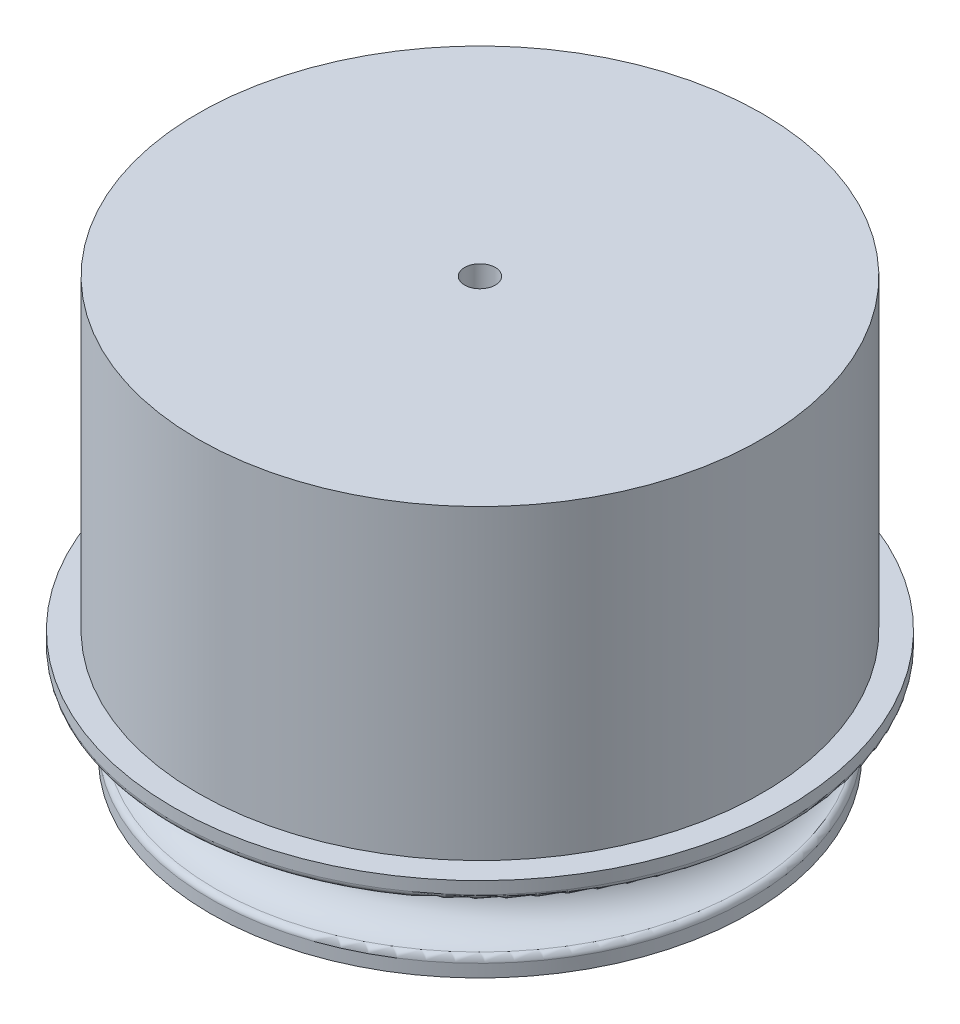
ISO-10303-21;
HEADER;
FILE_DESCRIPTION(('STEP AP214'),'2;1');
FILE_NAME('part.step','',(''),(''),'','','');
FILE_SCHEMA(('AUTOMOTIVE_DESIGN { 1 0 10303 214 1 1 1 1 }'));
ENDSEC;
DATA;
#1=APPLICATION_CONTEXT('core data for automotive mechanical design processes');
#2=APPLICATION_PROTOCOL_DEFINITION('international standard','automotive_design',2000,#1);
#3=PRODUCT_CONTEXT('',#1,'mechanical');
#4=PRODUCT('Part','Part','',(#3));
#5=PRODUCT_RELATED_PRODUCT_CATEGORY('part','',(#4));
#6=PRODUCT_DEFINITION_FORMATION('','',#4);
#7=PRODUCT_DEFINITION_CONTEXT('part definition',#1,'design');
#8=PRODUCT_DEFINITION('design','',#6,#7);
#9=PRODUCT_DEFINITION_SHAPE('','',#8);
#10=(LENGTH_UNIT() NAMED_UNIT(*) SI_UNIT(.MILLI.,.METRE.));
#11=(NAMED_UNIT(*) PLANE_ANGLE_UNIT() SI_UNIT($,.RADIAN.));
#12=(NAMED_UNIT(*) SI_UNIT($,.STERADIAN.) SOLID_ANGLE_UNIT());
#13=UNCERTAINTY_MEASURE_WITH_UNIT(LENGTH_MEASURE(1.E-05),#10,'distance_accuracy_value','');
#14=(GEOMETRIC_REPRESENTATION_CONTEXT(3) GLOBAL_UNCERTAINTY_ASSIGNED_CONTEXT((#13)) GLOBAL_UNIT_ASSIGNED_CONTEXT((#10,
#11,#12)) REPRESENTATION_CONTEXT('',''));
#15=CARTESIAN_POINT('',(0.,0.,0.));
#16=DIRECTION('',(0.,0.,1.));
#17=DIRECTION('',(1.,0.,0.));
#18=AXIS2_PLACEMENT_3D('',#15,#16,#17);
#19=CARTESIAN_POINT('',(0.,-8.99999999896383,0.));
#20=DIRECTION('',(0.,1.,0.));
#21=DIRECTION('',(0.,0.,1.));
#22=AXIS2_PLACEMENT_3D('',#19,#20,#21);
#23=CONICAL_SURFACE('',#22,21.9999999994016,1.04719754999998);
#24=CARTESIAN_POINT('',(0.,-9.00000000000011,0.));
#25=DIRECTION('',(0.,-1.,0.));
#26=DIRECTION('',(0.,0.,-1.));
#27=AXIS2_PLACEMENT_3D('',#24,#25,#26);
#28=CIRCLE('',#27,22.);
#29=CARTESIAN_POINT('',(0.,-9.00000000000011,-22.));
#30=VERTEX_POINT('',#29);
#31=EDGE_CURVE('E66',#30,#30,#28,.F.);
#32=ORIENTED_EDGE('',*,*,#31,.F.);
#33=EDGE_LOOP('',(#32));
#34=FACE_BOUND('',#33,.T.);
#35=CARTESIAN_POINT('',(0.,-10.0000000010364,0.));
#36=DIRECTION('',(0.,1.,0.));
#37=DIRECTION('',(0.,0.,1.));
#38=AXIS2_PLACEMENT_3D('',#35,#36,#37);
#39=CIRCLE('',#38,20.2679491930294);
#40=CARTESIAN_POINT('',(0.,-10.0000000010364,20.2679491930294));
#41=VERTEX_POINT('',#40);
#42=EDGE_CURVE('E17',#41,#41,#39,.F.);
#43=ORIENTED_EDGE('',*,*,#42,.F.);
#44=EDGE_LOOP('',(#43));
#45=FACE_BOUND('',#44,.T.);
#46=ADVANCED_FACE('F13',(#34,#45),#23,.T.);
#47=CARTESIAN_POINT('',(0.,-8.48205080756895,0.));
#48=DIRECTION('',(0.,-1.,0.));
#49=DIRECTION('',(0.,0.,-1.));
#50=AXIS2_PLACEMENT_3D('',#47,#48,#49);
#51=CYLINDRICAL_SURFACE('',#50,22.);
#52=CARTESIAN_POINT('',(0.,-7.96410161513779,0.));
#53=DIRECTION('',(0.,-1.,0.));
#54=DIRECTION('',(1.,0.,0.));
#55=AXIS2_PLACEMENT_3D('',#52,#53,#54);
#56=CIRCLE('',#55,22.);
#57=CARTESIAN_POINT('',(22.,-7.96410161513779,0.));
#58=VERTEX_POINT('',#57);
#59=EDGE_CURVE('E56',#58,#58,#56,.F.);
#60=ORIENTED_EDGE('',*,*,#59,.F.);
#61=EDGE_LOOP('',(#60));
#62=FACE_BOUND('',#61,.T.);
#63=ORIENTED_EDGE('',*,*,#31,.T.);
#64=EDGE_LOOP('',(#63));
#65=FACE_BOUND('',#64,.T.);
#66=ADVANCED_FACE('F75',(#62,#65),#51,.T.);
#67=CARTESIAN_POINT('',(14.6339745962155,-10.0000000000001,0.));
#68=DIRECTION('',(0.,-1.,0.));
#69=DIRECTION('',(0.,0.,-1.));
#70=AXIS2_PLACEMENT_3D('',#67,#68,#69);
#71=PLANE('',#70);
#72=CARTESIAN_POINT('',(0.,-10.0000000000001,0.));
#73=DIRECTION('',(0.,-1.,0.));
#74=DIRECTION('',(0.,0.,-1.));
#75=AXIS2_PLACEMENT_3D('',#72,#73,#74);
#76=CIRCLE('',#75,8.99999999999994);
#77=CARTESIAN_POINT('',(0.,-10.0000000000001,-8.99999999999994));
#78=VERTEX_POINT('',#77);
#79=EDGE_CURVE('E54',#78,#78,#76,.T.);
#80=ORIENTED_EDGE('',*,*,#79,.F.);
#81=EDGE_LOOP('',(#80));
#82=FACE_BOUND('',#81,.T.);
#83=ORIENTED_EDGE('',*,*,#42,.T.);
#84=EDGE_LOOP('',(#83));
#85=FACE_BOUND('',#84,.T.);
#86=ADVANCED_FACE('F81',(#82,#85),#71,.T.);
#87=CARTESIAN_POINT('',(0.,-7.96410161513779,0.));
#88=DIRECTION('',(0.,-1.,0.));
#89=DIRECTION('',(1.,0.,0.));
#90=AXIS2_PLACEMENT_3D('',#87,#88,#89);
#91=TOROIDAL_SURFACE('',#90,21.4999999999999,0.500000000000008);
#92=CARTESIAN_POINT('',(0.,-7.46922995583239,0.));
#93=DIRECTION('',(0.,1.,0.));
#94=DIRECTION('',(0.,0.,1.));
#95=AXIS2_PLACEMENT_3D('',#92,#93,#94);
#96=CIRCLE('',#95,21.5714285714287);
#97=CARTESIAN_POINT('',(0.,-7.46922995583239,21.5714285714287));
#98=VERTEX_POINT('',#97);
#99=EDGE_CURVE('E53',#98,#98,#96,.T.);
#100=ORIENTED_EDGE('',*,*,#99,.F.);
#101=EDGE_LOOP('',(#100));
#102=FACE_BOUND('',#101,.T.);
#103=ORIENTED_EDGE('',*,*,#59,.T.);
#104=EDGE_LOOP('',(#103));
#105=FACE_BOUND('',#104,.T.);
#106=ADVANCED_FACE('F83',(#102,#105),#91,.T.);
#107=CARTESIAN_POINT('',(0.,-10.5000000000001,0.));
#108=DIRECTION('',(0.,-1.,0.));
#109=DIRECTION('',(0.,0.,-1.));
#110=AXIS2_PLACEMENT_3D('',#107,#108,#109);
#111=CYLINDRICAL_SURFACE('',#110,8.99999999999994);
#112=ORIENTED_EDGE('',*,*,#79,.T.);
#113=EDGE_LOOP('',(#112));
#114=FACE_BOUND('',#113,.T.);
#115=CARTESIAN_POINT('',(0.,-11.0000000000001,0.));
#116=DIRECTION('',(0.,-1.,0.));
#117=DIRECTION('',(0.,0.,-1.));
#118=AXIS2_PLACEMENT_3D('',#115,#116,#117);
#119=CIRCLE('',#118,8.99999999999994);
#120=CARTESIAN_POINT('',(0.,-11.0000000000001,-8.99999999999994));
#121=VERTEX_POINT('',#120);
#122=EDGE_CURVE('E51',#121,#121,#119,.T.);
#123=ORIENTED_EDGE('',*,*,#122,.F.);
#124=EDGE_LOOP('',(#123));
#125=FACE_BOUND('',#124,.T.);
#126=ADVANCED_FACE('F91',(#114,#125),#111,.T.);
#127=CARTESIAN_POINT('',(0.,-4.5,0.));
#128=DIRECTION('',(0.,-1.,0.));
#129=DIRECTION('',(0.,0.,-1.));
#130=AXIS2_PLACEMENT_3D('',#127,#128,#129);
#131=TOROIDAL_SURFACE('',#130,21.9999999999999,3.);
#132=CARTESIAN_POINT('',(0.,-1.49999999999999,0.));
#133=DIRECTION('',(0.,-1.,0.));
#134=DIRECTION('',(0.,0.,-1.));
#135=AXIS2_PLACEMENT_3D('',#132,#133,#134);
#136=CIRCLE('',#135,21.9999999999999);
#137=CARTESIAN_POINT('',(0.,-1.49999999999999,-21.9999999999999));
#138=VERTEX_POINT('',#137);
#139=EDGE_CURVE('E48',#138,#138,#136,.F.);
#140=ORIENTED_EDGE('',*,*,#139,.F.);
#141=EDGE_LOOP('',(#140));
#142=FACE_BOUND('',#141,.T.);
#143=ORIENTED_EDGE('',*,*,#99,.T.);
#144=EDGE_LOOP('',(#143));
#145=FACE_BOUND('',#144,.T.);
#146=ADVANCED_FACE('F15',(#142,#145),#131,.F.);
#147=CARTESIAN_POINT('',(1.99999999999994,-11.0000000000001,0.));
#148=DIRECTION('',(0.,-1.,0.));
#149=DIRECTION('',(0.,0.,-1.));
#150=AXIS2_PLACEMENT_3D('',#147,#148,#149);
#151=PLANE('',#150);
#152=CARTESIAN_POINT('',(0.,-11.0000000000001,0.));
#153=DIRECTION('',(0.,1.,0.));
#154=DIRECTION('',(0.,0.,1.));
#155=AXIS2_PLACEMENT_3D('',#152,#153,#154);
#156=CIRCLE('',#155,4.);
#157=CARTESIAN_POINT('',(0.,-11.0000000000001,4.));
#158=VERTEX_POINT('',#157);
#159=EDGE_CURVE('E45',#158,#158,#156,.T.);
#160=ORIENTED_EDGE('',*,*,#159,.T.);
#161=EDGE_LOOP('',(#160));
#162=FACE_BOUND('',#161,.T.);
#163=ORIENTED_EDGE('',*,*,#122,.T.);
#164=EDGE_LOOP('',(#163));
#165=FACE_BOUND('',#164,.T.);
#166=ADVANCED_FACE('F153',(#162,#165),#151,.T.);
#167=CARTESIAN_POINT('',(23.25,-1.5,0.));
#168=DIRECTION('',(0.,-1.,0.));
#169=DIRECTION('',(0.,0.,-1.));
#170=AXIS2_PLACEMENT_3D('',#167,#168,#169);
#171=PLANE('',#170);
#172=ORIENTED_EDGE('',*,*,#139,.T.);
#173=EDGE_LOOP('',(#172));
#174=FACE_BOUND('',#173,.T.);
#175=CARTESIAN_POINT('',(0.,-1.5,0.));
#176=DIRECTION('',(0.,1.,0.));
#177=DIRECTION('',(1.,0.,0.));
#178=AXIS2_PLACEMENT_3D('',#175,#176,#177);
#179=CIRCLE('',#178,24.5);
#180=CARTESIAN_POINT('',(24.5,-1.5,0.));
#181=VERTEX_POINT('',#180);
#182=EDGE_CURVE('E44',#181,#181,#179,.T.);
#183=ORIENTED_EDGE('',*,*,#182,.F.);
#184=EDGE_LOOP('',(#183));
#185=FACE_BOUND('',#184,.T.);
#186=ADVANCED_FACE('F144',(#174,#185),#171,.T.);
#187=CARTESIAN_POINT('',(0.,-11.0000000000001,0.));
#188=DIRECTION('',(0.,1.,0.));
#189=DIRECTION('',(0.,0.,1.));
#190=AXIS2_PLACEMENT_3D('',#187,#188,#189);
#191=CYLINDRICAL_SURFACE('',#190,4.);
#192=ORIENTED_EDGE('',*,*,#159,.F.);
#193=EDGE_LOOP('',(#192));
#194=FACE_BOUND('',#193,.T.);
#195=CARTESIAN_POINT('',(0.,18.9999999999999,0.));
#196=DIRECTION('',(0.,1.,0.));
#197=DIRECTION('',(0.,0.,1.));
#198=AXIS2_PLACEMENT_3D('',#195,#196,#197);
#199=CIRCLE('',#198,4.);
#200=CARTESIAN_POINT('',(0.,18.9999999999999,4.));
#201=VERTEX_POINT('',#200);
#202=EDGE_CURVE('E41',#201,#201,#199,.F.);
#203=ORIENTED_EDGE('',*,*,#202,.F.);
#204=EDGE_LOOP('',(#203));
#205=FACE_BOUND('',#204,.T.);
#206=ADVANCED_FACE('F128',(#194,#205),#191,.F.);
#207=CARTESIAN_POINT('',(0.,-1.,0.));
#208=DIRECTION('',(0.,-1.,0.));
#209=DIRECTION('',(1.,0.,0.));
#210=AXIS2_PLACEMENT_3D('',#207,#208,#209);
#211=TOROIDAL_SURFACE('',#210,24.5,0.500000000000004);
#212=CARTESIAN_POINT('',(0.,-1.,0.));
#213=DIRECTION('',(0.,-1.,0.));
#214=DIRECTION('',(0.,0.,-1.));
#215=AXIS2_PLACEMENT_3D('',#212,#213,#214);
#216=CIRCLE('',#215,25.);
#217=CARTESIAN_POINT('',(0.,-1.,-25.));
#218=VERTEX_POINT('',#217);
#219=EDGE_CURVE('E40',#218,#218,#216,.F.);
#220=ORIENTED_EDGE('',*,*,#219,.F.);
#221=EDGE_LOOP('',(#220));
#222=FACE_BOUND('',#221,.T.);
#223=ORIENTED_EDGE('',*,*,#182,.T.);
#224=EDGE_LOOP('',(#223));
#225=FACE_BOUND('',#224,.T.);
#226=ADVANCED_FACE('F122',(#222,#225),#211,.T.);
#227=CARTESIAN_POINT('',(4.,18.9999999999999,0.));
#228=DIRECTION('',(0.,-1.,0.));
#229=DIRECTION('',(0.,0.,-1.));
#230=AXIS2_PLACEMENT_3D('',#227,#228,#229);
#231=PLANE('',#230);
#232=CARTESIAN_POINT('',(0.,18.9999999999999,0.));
#233=DIRECTION('',(0.,1.,0.));
#234=DIRECTION('',(0.,0.,1.));
#235=AXIS2_PLACEMENT_3D('',#232,#233,#234);
#236=CIRCLE('',#235,1.25);
#237=CARTESIAN_POINT('',(0.,18.9999999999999,1.25));
#238=VERTEX_POINT('',#237);
#239=EDGE_CURVE('E37',#238,#238,#236,.T.);
#240=ORIENTED_EDGE('',*,*,#239,.T.);
#241=EDGE_LOOP('',(#240));
#242=FACE_BOUND('',#241,.T.);
#243=ORIENTED_EDGE('',*,*,#202,.T.);
#244=EDGE_LOOP('',(#243));
#245=FACE_BOUND('',#244,.T.);
#246=ADVANCED_FACE('F118',(#242,#245),#231,.T.);
#247=CARTESIAN_POINT('',(0.,-0.5,0.));
#248=DIRECTION('',(0.,-1.,0.));
#249=DIRECTION('',(0.,0.,-1.));
#250=AXIS2_PLACEMENT_3D('',#247,#248,#249);
#251=CYLINDRICAL_SURFACE('',#250,25.);
#252=CARTESIAN_POINT('',(0.,0.,0.));
#253=DIRECTION('',(0.,-1.,0.));
#254=DIRECTION('',(0.,0.,-1.));
#255=AXIS2_PLACEMENT_3D('',#252,#253,#254);
#256=CIRCLE('',#255,25.);
#257=CARTESIAN_POINT('',(0.,0.,-25.));
#258=VERTEX_POINT('',#257);
#259=EDGE_CURVE('E34',#258,#258,#256,.F.);
#260=ORIENTED_EDGE('',*,*,#259,.F.);
#261=EDGE_LOOP('',(#260));
#262=FACE_BOUND('',#261,.T.);
#263=ORIENTED_EDGE('',*,*,#219,.T.);
#264=EDGE_LOOP('',(#263));
#265=FACE_BOUND('',#264,.T.);
#266=ADVANCED_FACE('F114',(#262,#265),#251,.T.);
#267=CARTESIAN_POINT('',(0.,18.9999999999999,0.));
#268=DIRECTION('',(0.,1.,0.));
#269=DIRECTION('',(0.,0.,1.));
#270=AXIS2_PLACEMENT_3D('',#267,#268,#269);
#271=CYLINDRICAL_SURFACE('',#270,1.25);
#272=ORIENTED_EDGE('',*,*,#239,.F.);
#273=EDGE_LOOP('',(#272));
#274=FACE_BOUND('',#273,.T.);
#275=CARTESIAN_POINT('',(0.,25.,0.));
#276=DIRECTION('',(0.,1.,0.));
#277=DIRECTION('',(0.,0.,1.));
#278=AXIS2_PLACEMENT_3D('',#275,#276,#277);
#279=CIRCLE('',#278,1.25);
#280=CARTESIAN_POINT('',(0.,25.,1.25));
#281=VERTEX_POINT('',#280);
#282=EDGE_CURVE('E26',#281,#281,#279,.F.);
#283=ORIENTED_EDGE('',*,*,#282,.F.);
#284=EDGE_LOOP('',(#283));
#285=FACE_BOUND('',#284,.T.);
#286=ADVANCED_FACE('F110',(#274,#285),#271,.F.);
#287=CARTESIAN_POINT('',(24.,0.,0.));
#288=DIRECTION('',(0.,1.,0.));
#289=DIRECTION('',(0.,0.,1.));
#290=AXIS2_PLACEMENT_3D('',#287,#288,#289);
#291=PLANE('',#290);
#292=CARTESIAN_POINT('',(0.,0.,0.));
#293=DIRECTION('',(0.,-1.,0.));
#294=DIRECTION('',(0.,0.,-1.));
#295=AXIS2_PLACEMENT_3D('',#292,#293,#294);
#296=CIRCLE('',#295,23.);
#297=CARTESIAN_POINT('',(0.,0.,-23.));
#298=VERTEX_POINT('',#297);
#299=EDGE_CURVE('E21',#298,#298,#296,.F.);
#300=ORIENTED_EDGE('',*,*,#299,.F.);
#301=EDGE_LOOP('',(#300));
#302=FACE_BOUND('',#301,.T.);
#303=ORIENTED_EDGE('',*,*,#259,.T.);
#304=EDGE_LOOP('',(#303));
#305=FACE_BOUND('',#304,.T.);
#306=ADVANCED_FACE('F103',(#302,#305),#291,.T.);
#307=CARTESIAN_POINT('',(11.5,25.,0.));
#308=DIRECTION('',(0.,1.,0.));
#309=DIRECTION('',(0.,0.,1.));
#310=AXIS2_PLACEMENT_3D('',#307,#308,#309);
#311=PLANE('',#310);
#312=ORIENTED_EDGE('',*,*,#282,.T.);
#313=EDGE_LOOP('',(#312));
#314=FACE_BOUND('',#313,.T.);
#315=CARTESIAN_POINT('',(0.,25.,0.));
#316=DIRECTION('',(0.,-1.,0.));
#317=DIRECTION('',(0.,0.,-1.));
#318=AXIS2_PLACEMENT_3D('',#315,#316,#317);
#319=CIRCLE('',#318,23.);
#320=CARTESIAN_POINT('',(0.,25.,-23.));
#321=VERTEX_POINT('',#320);
#322=EDGE_CURVE('E9',#321,#321,#319,.T.);
#323=ORIENTED_EDGE('',*,*,#322,.F.);
#324=EDGE_LOOP('',(#323));
#325=FACE_BOUND('',#324,.T.);
#326=ADVANCED_FACE('F98',(#314,#325),#311,.T.);
#327=CARTESIAN_POINT('',(0.,12.5,0.));
#328=DIRECTION('',(0.,-1.,0.));
#329=DIRECTION('',(0.,0.,-1.));
#330=AXIS2_PLACEMENT_3D('',#327,#328,#329);
#331=CYLINDRICAL_SURFACE('',#330,23.);
#332=ORIENTED_EDGE('',*,*,#322,.T.);
#333=EDGE_LOOP('',(#332));
#334=FACE_BOUND('',#333,.T.);
#335=ORIENTED_EDGE('',*,*,#299,.T.);
#336=EDGE_LOOP('',(#335));
#337=FACE_BOUND('',#336,.T.);
#338=ADVANCED_FACE('F96',(#334,#337),#331,.T.);
#339=CLOSED_SHELL('',(#46,#66,#86,#106,#126,#146,#166,#186,#206,#226,#246,#266,#286,#306,#326,#338));
#340=MANIFOLD_SOLID_BREP('B1',#339);
#341=ADVANCED_BREP_SHAPE_REPRESENTATION('',(#18,#340),#14);
#342=SHAPE_DEFINITION_REPRESENTATION(#9,#341);
ENDSEC;
END-ISO-10303-21;
